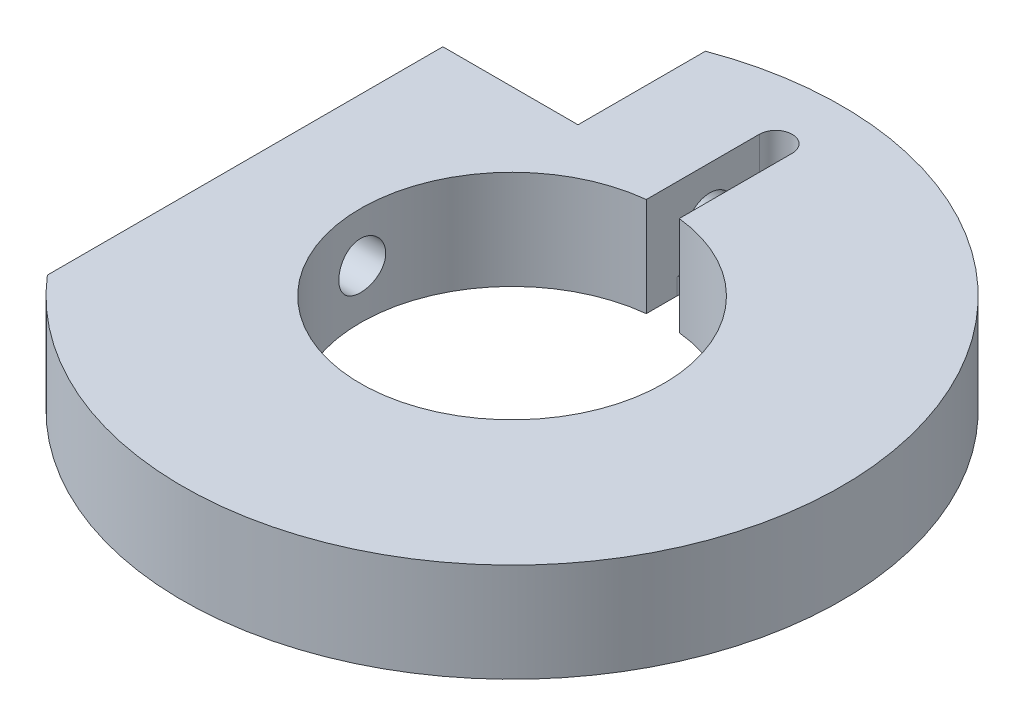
from build123d import *

# Parameters (mm, degrees)
SKETCH1_R                  = 15.875
SKETCH1_R_2                = 3.175
EXTRUDE1_DEPTH             = 4.7625
SKETCH10_R                 = 7.3025
CUT_EXTRUDE3_DEPTH         = 23.950221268
SKETCH11_R                 = 0.8001
CUT_EXTRUDE4_DEPTH         = 0.79375
CUT_EXTRUDE5_DEPTH         = 3.96875
CUT_EXTRUDE6_DEPTH         = 23.950221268
CUT_EXTRUDE7_DEPTH         = 23.950221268
F_4_40_TAPPED_HOLE1_D      = 2.2606
F_4_40_TAPPED_HOLE1_DEPTH  = 4.7625
F_4_40_TAPPED_HOLE2_REACH  = 34.486
F_4_40_TAPPED_HOLE2_BORE_R = 1.1303


with BuildPart() as part:
    # Sketch1 → Extrude1 (new body)
    with BuildSketch(Plane(origin=(0, 0, 0), x_dir=(1, 0, 0), z_dir=(0, 1, 0))):
        with Locations(Location((0, 0, 0), (0, 0, 90))):
            Circle(SKETCH1_R)
        with Locations(Location((0, 0, 0), (0, 0, 90))):
            Circle(SKETCH1_R_2, mode=Mode.SUBTRACT)
    extrude(amount=EXTRUDE1_DEPTH)

    # Sketch10 → Cut-Extrude3 (cut, through all)
    with BuildSketch(Plane.XZ):
        with Locations(Location((0, 0, 0), (0, 0, 270))):
            Circle(SKETCH10_R)
    extrude(amount=-CUT_EXTRUDE3_DEPTH, mode=Mode.SUBTRACT)

    # Sketch11 → Cut-Extrude4 (cut)
    with BuildSketch(Plane(origin=(0, 0, 0), x_dir=(1, 0, 0), z_dir=(0, 1, 0))):
        with Locations(Location((0, 12.7, 0), (0, 0, 270))):
            Circle(SKETCH11_R)
    extrude(amount=CUT_EXTRUDE4_DEPTH, mode=Mode.SUBTRACT)

    # Sketch12 → Cut-Extrude5 (cut)
    with BuildSketch(Plane(origin=(0, 4.7625, 0), x_dir=(1, 0, 0), z_dir=(0, 1, 0))):
        with BuildLine():
            Line((-0.79375, 5.06095), (-0.79375, 12.7))
            ThreePointArc((-0.79375, 12.7), (0, 13.49375), (0.79375, 12.7))
            Line((0.79375, 12.7), (0.79375, 5.06095))
            ThreePointArc((0.79375, 5.06095), (0, 4.2672), (-0.79375, 5.06095))
        make_face()
    extrude(amount=-CUT_EXTRUDE5_DEPTH, mode=Mode.SUBTRACT)

    # Sketch13 → Cut-Extrude6 (cut, through all)
    with BuildSketch(Plane(origin=(0, 4.7625, 0), x_dir=(1, 0, 0), z_dir=(0, 1, 0))):
        with BuildLine():
            Line((-0.79375, 8.73125), (-0.79375, 4.913403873))
            Line((-0.79375, 4.913403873), (0.79375, 4.913403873))
            Line((0.79375, 4.913403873), (0.79375, 8.73125))
            ThreePointArc((0.79375, 8.73125), (0, 9.525), (-0.79375, 8.73125))
        make_face()
    extrude(amount=-CUT_EXTRUDE6_DEPTH, mode=Mode.SUBTRACT)

    # Sketch14 → Cut-Extrude7 (cut, through all)
    with BuildSketch(Plane.XZ):
        Polygon((-5.55625, -8.73125), (-12.065, -8.73125), (-12.065, 12.152938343), (-21.807488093, 12.152938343), (-21.807488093, -18.644739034), (-5.55625, -18.644739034), align=None)
    extrude(amount=-CUT_EXTRUDE7_DEPTH, mode=Mode.SUBTRACT)

    # 4-40 Tapped Hole1
    with Locations(Plane(origin=(-5.55625, 0.140149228, -0.408658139), x_dir=(0, 0, 1), z_dir=(-1, 0, 0))):
        with Locations((-9.910091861, 2.241100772)):
            Hole(F_4_40_TAPPED_HOLE1_D / 2, depth=F_4_40_TAPPED_HOLE1_DEPTH)

    # 4-40 Tapped Hole2 bore → 4-40 Tapped Hole2 (cut, up to next)
    with BuildSketch(Plane.ZY.offset(12.065), mode=Mode.PRIVATE) as f_4_40_tapped_hole2_sk1:
        with Locations((0, 2.38125)):
            Circle(F_4_40_TAPPED_HOLE2_BORE_R)
    f_4_40_tapped_hole2_tool1 = extrude(f_4_40_tapped_hole2_sk1.sketch, amount=-F_4_40_TAPPED_HOLE2_REACH, mode=Mode.PRIVATE) & part.part
    add(f_4_40_tapped_hole2_tool1.solids().sort_by_distance((-12.065, 2.38125, 0))[0], mode=Mode.SUBTRACT)


solid = part.part
